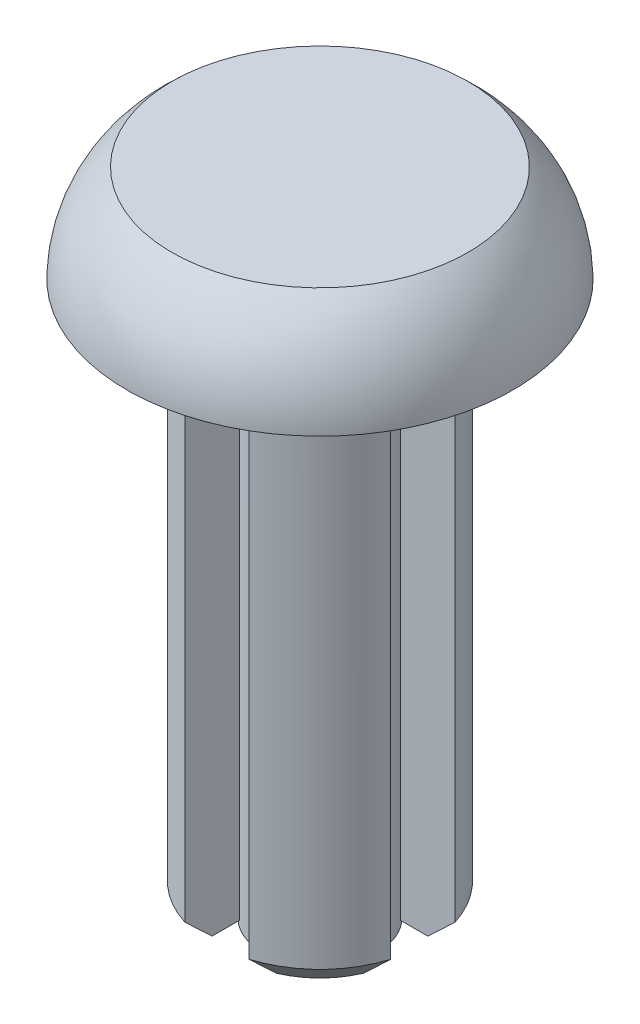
from build123d import *

# Parameters (mm, degrees)
SKETCH2_W          = 0.98425
SKETCH2_H          = 0.635005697
CUT_EXTRUDE1_DEPTH = 10.16
CIRPATTERN1_COUNT  = 4
CHAMFER1_SIZE      = 0.508


with BuildPart() as part:
    # Sketch1 → Revolve1 (revolve)
    with BuildSketch(Plane.XY):
        with BuildLine():
            Line((-2.12725, 0.905), (-2.12725, -11.4394))
            Line((-2.12725, -11.4394), (0, -11.4394))
            Line((0, -11.4394), (0, 1.905))
            Line((0, 1.905), (-2.921, 1.905))
            ThreePointArc((-2.921, 1.905), (-3.565448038, 1.045809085), (-3.81, 0))
            Line((-3.81, 0), (-2.810259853, -0.022795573))
            ThreePointArc((-2.810259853, -0.022795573), (-2.722709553, 0.465976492), (-2.49071484, 0.905))
            Line((-2.49071484, 0.905), (-2.12725, 0.905))
        make_face()
    revolve(axis=Axis((0, 1.905, 0), (0, -1, 0)))

    # Sketch2 → Cut-Revolve1 (revolve, cut)
    with BuildSketch(Plane(origin=(0, 0, 0), x_dir=(0, 0, -1), z_dir=(1, 0, 0)), mode=Mode.PRIVATE) as cut_revolve1_sk:
        with Locations((1.635125, -11.121897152)):
            Rectangle(SKETCH2_W, SKETCH2_H)
    revolve(cut_revolve1_sk.sketch.rotate(Axis((0, -11.4394, 0), (0, 1, 0)), 90), axis=Axis((0, -11.4394, 0), (0, 1, 0)), mode=Mode.SUBTRACT)

    # Sketch3 → Cut-Extrude1 (cut)
    with BuildSketch(Plane.XZ.offset(10.804394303)):
        with BuildLine():
            Line((0.635, 0.950380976), (0.635, 2.030262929))
            ThreePointArc((0.635, 2.030262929), (0, 2.12725), (-0.635, 2.030262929))
            Line((-0.635, 2.030262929), (-0.635, 0.950380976))
            ThreePointArc((-0.635, 0.950380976), (0, 1.143), (0.635, 0.950380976))
        make_face()
    cut_extrude1 = extrude(amount=-CUT_EXTRUDE1_DEPTH, mode=Mode.SUBTRACT)

    # CirPattern1: Cut-Extrude1 ×4 about axis
    cirpattern1_axis = Axis((0, 0, 0), (0, 1, 0))
    for i in range(1, CIRPATTERN1_COUNT):
        add(cut_extrude1.rotate(cirpattern1_axis, i * 360 / CIRPATTERN1_COUNT), mode=Mode.SUBTRACT)

    # Chamfer1
    chamfer1_edges = [part.edges().sort_by_distance(p)[0] for p in [
        (1.143, -11.4394, 0),
        (-1.5041929, -10.804394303, 1.5041929),
        (1.5041929, -10.804394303, 1.5041929),
        (1.5041929, -10.804394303, -1.5041929),
        (-1.5041929, -10.804394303, -1.5041929),
    ]]
    chamfer(chamfer1_edges, length=CHAMFER1_SIZE)


solid = part.part
